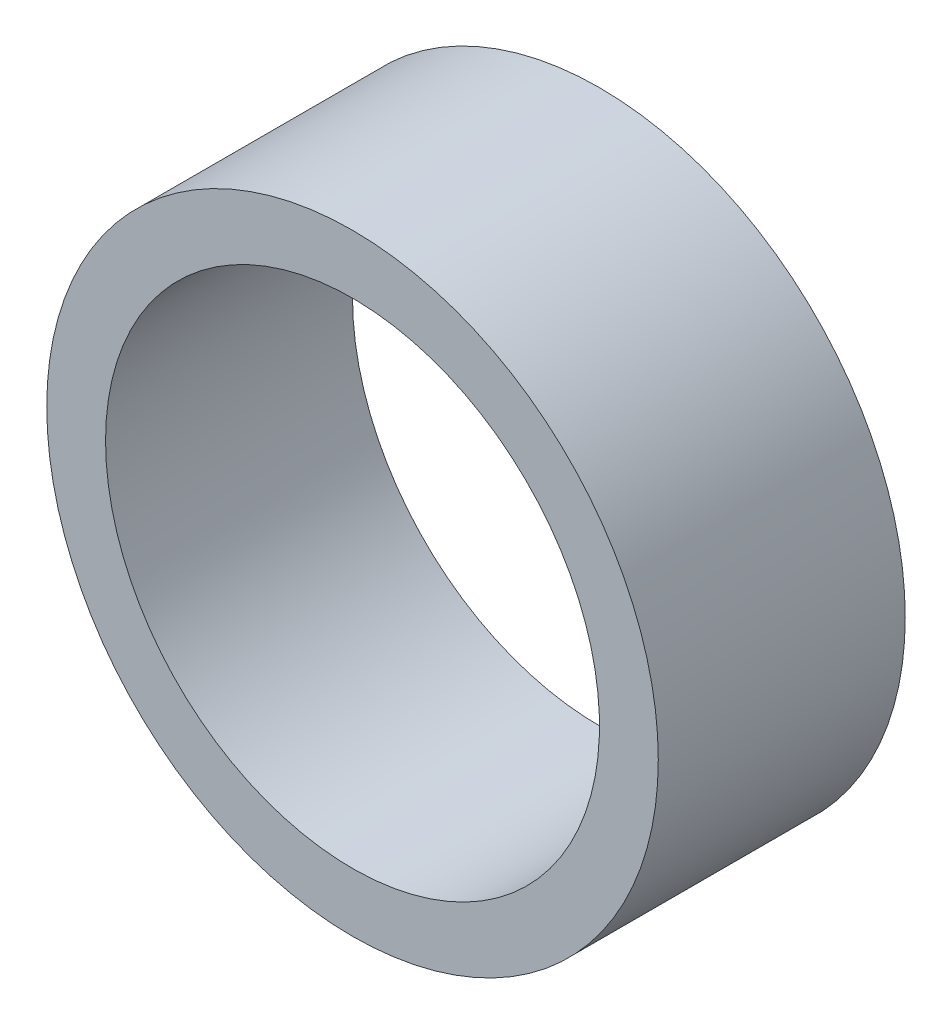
from build123d import *

# Parameters (mm, degrees)
SKETCH1_R      = 26
SKETCH1_R_2    = 21
EXTRUDE1_DEPTH = 21


with BuildPart() as part:
    # Sketch1 → Extrude1 (new body)
    with BuildSketch(Plane.XY):
        with Locations(Location((0, 0, 0), (0, 0, 180))):
            Circle(SKETCH1_R)
        with Locations(Location((0, 0, 0), (0, 0, 180))):
            Circle(SKETCH1_R_2, mode=Mode.SUBTRACT)
    extrude(amount=EXTRUDE1_DEPTH)


solid = part.part
